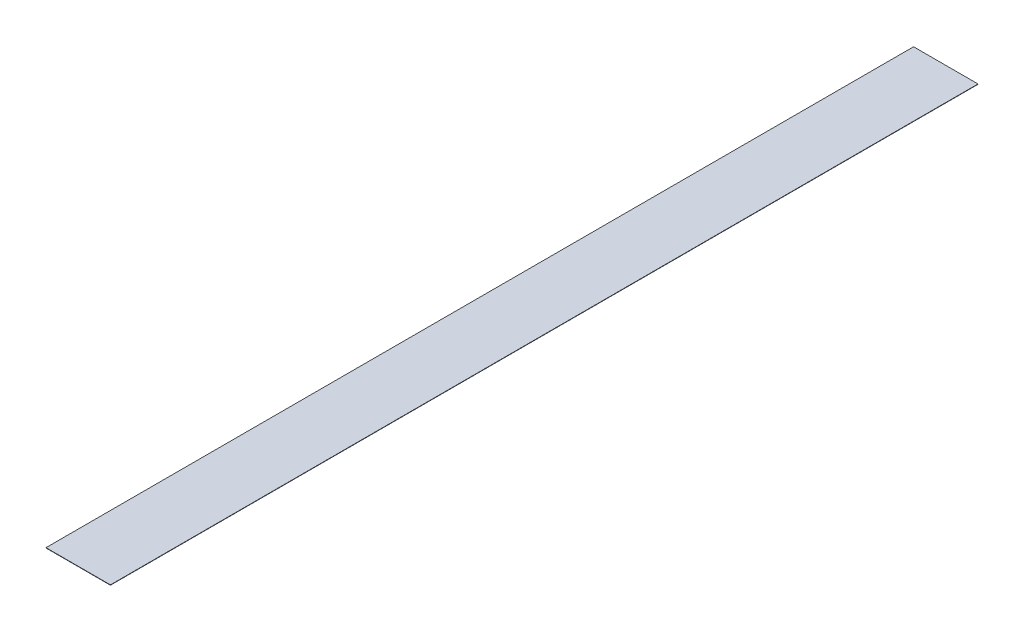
from build123d import *

# Parameters (mm, degrees)
SKETCH1_W           = 47.625
SKETCH1_H           = 641.35
BOSS_EXTRUDE1_DEPTH = 0.254


with BuildPart() as part:
    # Sketch1 → Boss-Extrude1 (new body)
    with BuildSketch(Plane(origin=(0, 0, 0), x_dir=(1, 0, 0), z_dir=(0, 1, 0))):
        Rectangle(SKETCH1_W, SKETCH1_H)
    extrude(amount=BOSS_EXTRUDE1_DEPTH)


solid = part.part
